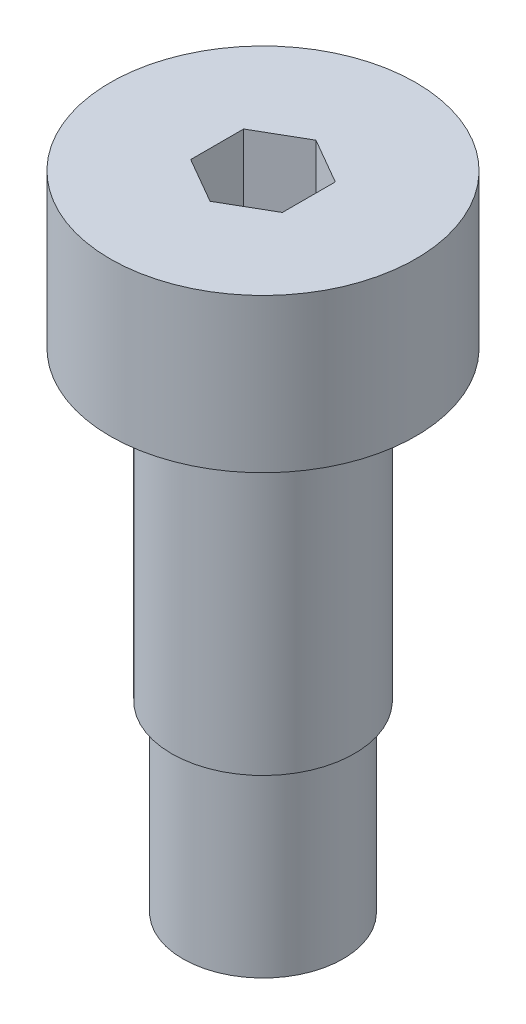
ISO-10303-21;
HEADER;
FILE_DESCRIPTION(('STEP AP214'),'2;1');
FILE_NAME('part.step','',(''),(''),'','','');
FILE_SCHEMA(('AUTOMOTIVE_DESIGN { 1 0 10303 214 1 1 1 1 }'));
ENDSEC;
DATA;
#1=APPLICATION_CONTEXT('core data for automotive mechanical design processes');
#2=APPLICATION_PROTOCOL_DEFINITION('international standard','automotive_design',2000,#1);
#3=PRODUCT_CONTEXT('',#1,'mechanical');
#4=PRODUCT('Part','Part','',(#3));
#5=PRODUCT_RELATED_PRODUCT_CATEGORY('part','',(#4));
#6=PRODUCT_DEFINITION_FORMATION('','',#4);
#7=PRODUCT_DEFINITION_CONTEXT('part definition',#1,'design');
#8=PRODUCT_DEFINITION('design','',#6,#7);
#9=PRODUCT_DEFINITION_SHAPE('','',#8);
#10=(LENGTH_UNIT() NAMED_UNIT(*) SI_UNIT(.MILLI.,.METRE.));
#11=(NAMED_UNIT(*) PLANE_ANGLE_UNIT() SI_UNIT($,.RADIAN.));
#12=(NAMED_UNIT(*) SI_UNIT($,.STERADIAN.) SOLID_ANGLE_UNIT());
#13=UNCERTAINTY_MEASURE_WITH_UNIT(LENGTH_MEASURE(1.E-05),#10,'distance_accuracy_value','');
#14=(GEOMETRIC_REPRESENTATION_CONTEXT(3) GLOBAL_UNCERTAINTY_ASSIGNED_CONTEXT((#13)) GLOBAL_UNIT_ASSIGNED_CONTEXT((#10,
#11,#12)) REPRESENTATION_CONTEXT('',''));
#15=CARTESIAN_POINT('',(0.,0.,0.));
#16=DIRECTION('',(0.,0.,1.));
#17=DIRECTION('',(1.,0.,0.));
#18=AXIS2_PLACEMENT_3D('',#15,#16,#17);
#19=CARTESIAN_POINT('',(0.,3.9878,0.));
#20=DIRECTION('',(0.,-1.,0.));
#21=DIRECTION('',(0.,0.,-1.));
#22=AXIS2_PLACEMENT_3D('',#19,#20,#21);
#23=PLANE('',#22);
#24=DIRECTION('',(0.866025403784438,0.,-0.5));
#25=VECTOR('',#24,1.);
#26=CARTESIAN_POINT('',(0.,3.9878,1.37481532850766));
#27=LINE('',#26,#25);
#28=CARTESIAN_POINT('',(0.,3.9878,1.37481532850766));
#29=VERTEX_POINT('',#28);
#30=CARTESIAN_POINT('',(1.190625,3.9878,0.687407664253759));
#31=VERTEX_POINT('',#30);
#32=EDGE_CURVE('E102',#29,#31,#27,.T.);
#33=ORIENTED_EDGE('',*,*,#32,.F.);
#34=DIRECTION('',(0.866025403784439,0.,0.5));
#35=VECTOR('',#34,1.);
#36=CARTESIAN_POINT('',(-1.19062499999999,3.9878,0.68740766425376));
#37=LINE('',#36,#35);
#38=CARTESIAN_POINT('',(-1.19062499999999,3.9878,0.68740766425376));
#39=VERTEX_POINT('',#38);
#40=EDGE_CURVE('E48',#39,#29,#37,.T.);
#41=ORIENTED_EDGE('',*,*,#40,.F.);
#42=DIRECTION('',(0.,0.,1.));
#43=VECTOR('',#42,1.);
#44=CARTESIAN_POINT('',(-1.190625,3.9878,-0.687407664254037));
#45=LINE('',#44,#43);
#46=CARTESIAN_POINT('',(-1.190625,3.9878,-0.687407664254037));
#47=VERTEX_POINT('',#46);
#48=EDGE_CURVE('E117',#47,#39,#45,.T.);
#49=ORIENTED_EDGE('',*,*,#48,.F.);
#50=DIRECTION('',(-0.866025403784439,0.,0.5));
#51=VECTOR('',#50,1.);
#52=CARTESIAN_POINT('',(0.,3.9878,-1.37481532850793));
#53=LINE('',#52,#51);
#54=CARTESIAN_POINT('',(0.,3.9878,-1.37481532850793));
#55=VERTEX_POINT('',#54);
#56=EDGE_CURVE('E111',#55,#47,#53,.T.);
#57=ORIENTED_EDGE('',*,*,#56,.F.);
#58=DIRECTION('',(-0.866025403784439,0.,-0.5));
#59=VECTOR('',#58,1.);
#60=CARTESIAN_POINT('',(1.190625,3.9878,-0.687407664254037));
#61=LINE('',#60,#59);
#62=CARTESIAN_POINT('',(1.190625,3.9878,-0.687407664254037));
#63=VERTEX_POINT('',#62);
#64=EDGE_CURVE('E109',#63,#55,#61,.T.);
#65=ORIENTED_EDGE('',*,*,#64,.F.);
#66=DIRECTION('',(0.,0.,-1.));
#67=VECTOR('',#66,1.);
#68=CARTESIAN_POINT('',(1.190625,3.9878,0.687407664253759));
#69=LINE('',#68,#67);
#70=EDGE_CURVE('E91',#31,#63,#69,.T.);
#71=ORIENTED_EDGE('',*,*,#70,.F.);
#72=EDGE_LOOP('',(#33,#41,#49,#57,#65,#71));
#73=FACE_BOUND('',#72,.T.);
#74=CARTESIAN_POINT('',(0.,3.9878,0.));
#75=DIRECTION('',(0.,1.,0.));
#76=DIRECTION('',(0.,0.,1.));
#77=AXIS2_PLACEMENT_3D('',#74,#75,#76);
#78=CIRCLE('',#77,3.96875);
#79=CARTESIAN_POINT('',(0.,3.9878,3.96875000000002));
#80=VERTEX_POINT('',#79);
#81=EDGE_CURVE('E11',#80,#80,#78,.T.);
#82=ORIENTED_EDGE('',*,*,#81,.T.);
#83=EDGE_LOOP('',(#82));
#84=FACE_BOUND('',#83,.T.);
#85=ADVANCED_FACE('F34',(#73,#84),#23,.F.);
#86=CARTESIAN_POINT('',(0.,49.1434782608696,-1.38777878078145E-13));
#87=DIRECTION('',(0.,1.,0.));
#88=DIRECTION('',(0.,0.,1.));
#89=AXIS2_PLACEMENT_3D('',#86,#87,#88);
#90=CYLINDRICAL_SURFACE('',#89,3.96875000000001);
#91=ORIENTED_EDGE('',*,*,#81,.F.);
#92=EDGE_LOOP('',(#91));
#93=FACE_BOUND('',#92,.T.);
#94=CARTESIAN_POINT('',(0.,0.,0.));
#95=DIRECTION('',(0.,1.,0.));
#96=DIRECTION('',(0.,0.,1.));
#97=AXIS2_PLACEMENT_3D('',#94,#95,#96);
#98=CIRCLE('',#97,3.96875000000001);
#99=CARTESIAN_POINT('',(0.,0.,3.96875000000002));
#100=VERTEX_POINT('',#99);
#101=EDGE_CURVE('E41',#100,#100,#98,.T.);
#102=ORIENTED_EDGE('',*,*,#101,.T.);
#103=EDGE_LOOP('',(#102));
#104=FACE_BOUND('',#103,.T.);
#105=ADVANCED_FACE('F155',(#93,#104),#90,.T.);
#106=CARTESIAN_POINT('',(3.96875000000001,0.,0.));
#107=DIRECTION('',(0.,1.,0.));
#108=DIRECTION('',(0.,0.,1.));
#109=AXIS2_PLACEMENT_3D('',#106,#107,#108);
#110=PLANE('',#109);
#111=ORIENTED_EDGE('',*,*,#101,.F.);
#112=EDGE_LOOP('',(#111));
#113=FACE_BOUND('',#112,.T.);
#114=CARTESIAN_POINT('',(0.,0.,0.));
#115=DIRECTION('',(0.,1.,0.));
#116=DIRECTION('',(0.,0.,1.));
#117=AXIS2_PLACEMENT_3D('',#114,#115,#116);
#118=CIRCLE('',#117,2.37490000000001);
#119=CARTESIAN_POINT('',(0.,0.,2.37490000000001));
#120=VERTEX_POINT('',#119);
#121=EDGE_CURVE('E150',#120,#120,#118,.T.);
#122=ORIENTED_EDGE('',*,*,#121,.T.);
#123=EDGE_LOOP('',(#122));
#124=FACE_BOUND('',#123,.T.);
#125=ADVANCED_FACE('F157',(#113,#124),#110,.F.);
#126=CARTESIAN_POINT('',(0.,49.1434782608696,-1.38777878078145E-13));
#127=DIRECTION('',(0.,1.,0.));
#128=DIRECTION('',(0.,0.,1.));
#129=AXIS2_PLACEMENT_3D('',#126,#127,#128);
#130=CYLINDRICAL_SURFACE('',#129,2.37490000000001);
#131=ORIENTED_EDGE('',*,*,#121,.F.);
#132=EDGE_LOOP('',(#131));
#133=FACE_BOUND('',#132,.T.);
#134=CARTESIAN_POINT('',(0.,-7.9375,0.));
#135=DIRECTION('',(0.,1.,0.));
#136=DIRECTION('',(0.,0.,1.));
#137=AXIS2_PLACEMENT_3D('',#134,#135,#136);
#138=CIRCLE('',#137,2.37490000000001);
#139=CARTESIAN_POINT('',(0.,-7.9375,2.37490000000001));
#140=VERTEX_POINT('',#139);
#141=EDGE_CURVE('E147',#140,#140,#138,.T.);
#142=ORIENTED_EDGE('',*,*,#141,.T.);
#143=EDGE_LOOP('',(#142));
#144=FACE_BOUND('',#143,.T.);
#145=ADVANCED_FACE('F160',(#133,#144),#130,.T.);
#146=CARTESIAN_POINT('',(2.37490000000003,-7.9375,-1.38777878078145E-13));
#147=DIRECTION('',(0.,1.,0.));
#148=DIRECTION('',(0.,0.,1.));
#149=AXIS2_PLACEMENT_3D('',#146,#147,#148);
#150=PLANE('',#149);
#151=ORIENTED_EDGE('',*,*,#141,.F.);
#152=EDGE_LOOP('',(#151));
#153=FACE_BOUND('',#152,.T.);
#154=CARTESIAN_POINT('',(0.,-7.9375,0.));
#155=DIRECTION('',(0.,1.,0.));
#156=DIRECTION('',(0.,0.,1.));
#157=AXIS2_PLACEMENT_3D('',#154,#155,#156);
#158=CIRCLE('',#157,2.08280000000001);
#159=CARTESIAN_POINT('',(0.,-7.9375,2.08280000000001));
#160=VERTEX_POINT('',#159);
#161=EDGE_CURVE('E144',#160,#160,#158,.T.);
#162=ORIENTED_EDGE('',*,*,#161,.T.);
#163=EDGE_LOOP('',(#162));
#164=FACE_BOUND('',#163,.T.);
#165=ADVANCED_FACE('F166',(#153,#164),#150,.F.);
#166=CARTESIAN_POINT('',(0.,49.1434782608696,-1.38777878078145E-13));
#167=DIRECTION('',(0.,1.,0.));
#168=DIRECTION('',(0.,0.,1.));
#169=AXIS2_PLACEMENT_3D('',#166,#167,#168);
#170=CYLINDRICAL_SURFACE('',#169,2.08280000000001);
#171=ORIENTED_EDGE('',*,*,#161,.F.);
#172=EDGE_LOOP('',(#171));
#173=FACE_BOUND('',#172,.T.);
#174=CARTESIAN_POINT('',(0.,-12.7,0.));
#175=DIRECTION('',(0.,1.,0.));
#176=DIRECTION('',(0.,0.,1.));
#177=AXIS2_PLACEMENT_3D('',#174,#175,#176);
#178=CIRCLE('',#177,2.08280000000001);
#179=CARTESIAN_POINT('',(0.,-12.7,2.08280000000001));
#180=VERTEX_POINT('',#179);
#181=EDGE_CURVE('E135',#180,#180,#178,.T.);
#182=ORIENTED_EDGE('',*,*,#181,.T.);
#183=EDGE_LOOP('',(#182));
#184=FACE_BOUND('',#183,.T.);
#185=ADVANCED_FACE('F172',(#173,#184),#170,.T.);
#186=CARTESIAN_POINT('',(2.08280000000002,-12.7,0.));
#187=DIRECTION('',(0.,1.,0.));
#188=DIRECTION('',(0.,0.,1.));
#189=AXIS2_PLACEMENT_3D('',#186,#187,#188);
#190=PLANE('',#189);
#191=ORIENTED_EDGE('',*,*,#181,.F.);
#192=EDGE_LOOP('',(#191));
#193=FACE_BOUND('',#192,.T.);
#194=ADVANCED_FACE('F178',(#193),#190,.F.);
#195=CARTESIAN_POINT('',(-1.19062499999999,1.60655,0.68740766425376));
#196=DIRECTION('',(-0.5,0.,0.866025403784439));
#197=DIRECTION('',(0.866025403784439,0.,0.5));
#198=AXIS2_PLACEMENT_3D('',#195,#196,#197);
#199=PLANE('',#198);
#200=ORIENTED_EDGE('',*,*,#40,.T.);
#201=DIRECTION('',(0.,1.,0.));
#202=VECTOR('',#201,1.);
#203=CARTESIAN_POINT('',(0.,1.60655,1.37481532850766));
#204=LINE('',#203,#202);
#205=CARTESIAN_POINT('',(0.,1.60655,1.37481532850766));
#206=VERTEX_POINT('',#205);
#207=EDGE_CURVE('E99',#206,#29,#204,.T.);
#208=ORIENTED_EDGE('',*,*,#207,.F.);
#209=DIRECTION('',(0.866025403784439,0.,0.5));
#210=VECTOR('',#209,1.);
#211=CARTESIAN_POINT('',(-1.19062499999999,1.60655,0.68740766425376));
#212=LINE('',#211,#210);
#213=CARTESIAN_POINT('',(-1.19062499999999,1.60655,0.68740766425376));
#214=VERTEX_POINT('',#213);
#215=EDGE_CURVE('E119',#214,#206,#212,.T.);
#216=ORIENTED_EDGE('',*,*,#215,.F.);
#217=DIRECTION('',(0.,1.,0.));
#218=VECTOR('',#217,1.);
#219=CARTESIAN_POINT('',(-1.19062499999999,1.60655,0.68740766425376));
#220=LINE('',#219,#218);
#221=EDGE_CURVE('E55',#214,#39,#220,.T.);
#222=ORIENTED_EDGE('',*,*,#221,.T.);
#223=EDGE_LOOP('',(#200,#208,#216,#222));
#224=FACE_BOUND('',#223,.T.);
#225=ADVANCED_FACE('F183',(#224),#199,.F.);
#226=CARTESIAN_POINT('',(-1.190625,1.60655,-0.687407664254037));
#227=DIRECTION('',(-1.,0.,0.));
#228=DIRECTION('',(0.,0.,1.));
#229=AXIS2_PLACEMENT_3D('',#226,#227,#228);
#230=PLANE('',#229);
#231=ORIENTED_EDGE('',*,*,#48,.T.);
#232=ORIENTED_EDGE('',*,*,#221,.F.);
#233=DIRECTION('',(0.,0.,1.));
#234=VECTOR('',#233,1.);
#235=CARTESIAN_POINT('',(-1.190625,1.60655,-0.687407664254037));
#236=LINE('',#235,#234);
#237=CARTESIAN_POINT('',(-1.190625,1.60655,-0.687407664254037));
#238=VERTEX_POINT('',#237);
#239=EDGE_CURVE('E131',#238,#214,#236,.T.);
#240=ORIENTED_EDGE('',*,*,#239,.F.);
#241=DIRECTION('',(0.,1.,0.));
#242=VECTOR('',#241,1.);
#243=CARTESIAN_POINT('',(-1.190625,1.60655,-0.687407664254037));
#244=LINE('',#243,#242);
#245=EDGE_CURVE('E136',#238,#47,#244,.T.);
#246=ORIENTED_EDGE('',*,*,#245,.T.);
#247=EDGE_LOOP('',(#231,#232,#240,#246));
#248=FACE_BOUND('',#247,.T.);
#249=ADVANCED_FACE('F188',(#248),#230,.F.);
#250=CARTESIAN_POINT('',(0.,1.60655,-1.37481532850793));
#251=DIRECTION('',(-0.5,0.,-0.866025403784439));
#252=DIRECTION('',(-0.866025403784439,0.,0.5));
#253=AXIS2_PLACEMENT_3D('',#250,#251,#252);
#254=PLANE('',#253);
#255=ORIENTED_EDGE('',*,*,#56,.T.);
#256=ORIENTED_EDGE('',*,*,#245,.F.);
#257=DIRECTION('',(-0.866025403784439,0.,0.5));
#258=VECTOR('',#257,1.);
#259=CARTESIAN_POINT('',(0.,1.60655,-1.37481532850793));
#260=LINE('',#259,#258);
#261=CARTESIAN_POINT('',(0.,1.60655,-1.37481532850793));
#262=VERTEX_POINT('',#261);
#263=EDGE_CURVE('E128',#262,#238,#260,.T.);
#264=ORIENTED_EDGE('',*,*,#263,.F.);
#265=DIRECTION('',(0.,1.,0.));
#266=VECTOR('',#265,1.);
#267=CARTESIAN_POINT('',(0.,1.60655,-1.37481532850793));
#268=LINE('',#267,#266);
#269=EDGE_CURVE('E138',#262,#55,#268,.T.);
#270=ORIENTED_EDGE('',*,*,#269,.T.);
#271=EDGE_LOOP('',(#255,#256,#264,#270));
#272=FACE_BOUND('',#271,.T.);
#273=ADVANCED_FACE('F237',(#272),#254,.F.);
#274=CARTESIAN_POINT('',(1.190625,1.60655,-0.687407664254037));
#275=DIRECTION('',(0.5,0.,-0.866025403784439));
#276=DIRECTION('',(-0.866025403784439,0.,-0.5));
#277=AXIS2_PLACEMENT_3D('',#274,#275,#276);
#278=PLANE('',#277);
#279=ORIENTED_EDGE('',*,*,#64,.T.);
#280=ORIENTED_EDGE('',*,*,#269,.F.);
#281=DIRECTION('',(-0.866025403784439,0.,-0.5));
#282=VECTOR('',#281,1.);
#283=CARTESIAN_POINT('',(1.190625,1.60655,-0.687407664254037));
#284=LINE('',#283,#282);
#285=CARTESIAN_POINT('',(1.190625,1.60655,-0.687407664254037));
#286=VERTEX_POINT('',#285);
#287=EDGE_CURVE('E125',#286,#262,#284,.T.);
#288=ORIENTED_EDGE('',*,*,#287,.F.);
#289=DIRECTION('',(0.,1.,0.));
#290=VECTOR('',#289,1.);
#291=CARTESIAN_POINT('',(1.190625,1.60655,-0.687407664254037));
#292=LINE('',#291,#290);
#293=EDGE_CURVE('E98',#286,#63,#292,.T.);
#294=ORIENTED_EDGE('',*,*,#293,.T.);
#295=EDGE_LOOP('',(#279,#280,#288,#294));
#296=FACE_BOUND('',#295,.T.);
#297=ADVANCED_FACE('F246',(#296),#278,.F.);
#298=CARTESIAN_POINT('',(1.190625,1.60655,0.687407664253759));
#299=DIRECTION('',(1.,0.,0.));
#300=DIRECTION('',(0.,0.,-1.));
#301=AXIS2_PLACEMENT_3D('',#298,#299,#300);
#302=PLANE('',#301);
#303=ORIENTED_EDGE('',*,*,#70,.T.);
#304=ORIENTED_EDGE('',*,*,#293,.F.);
#305=DIRECTION('',(0.,0.,-1.));
#306=VECTOR('',#305,1.);
#307=CARTESIAN_POINT('',(1.190625,1.60655,0.687407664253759));
#308=LINE('',#307,#306);
#309=CARTESIAN_POINT('',(1.190625,1.60655,0.687407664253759));
#310=VERTEX_POINT('',#309);
#311=EDGE_CURVE('E94',#310,#286,#308,.T.);
#312=ORIENTED_EDGE('',*,*,#311,.F.);
#313=DIRECTION('',(0.,1.,0.));
#314=VECTOR('',#313,1.);
#315=CARTESIAN_POINT('',(1.190625,1.60655,0.687407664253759));
#316=LINE('',#315,#314);
#317=EDGE_CURVE('E87',#310,#31,#316,.T.);
#318=ORIENTED_EDGE('',*,*,#317,.T.);
#319=EDGE_LOOP('',(#303,#304,#312,#318));
#320=FACE_BOUND('',#319,.T.);
#321=ADVANCED_FACE('F89',(#320),#302,.F.);
#322=CARTESIAN_POINT('',(0.,1.60655,1.37481532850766));
#323=DIRECTION('',(0.5,0.,0.866025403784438));
#324=DIRECTION('',(0.866025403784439,0.,-0.5));
#325=AXIS2_PLACEMENT_3D('',#322,#323,#324);
#326=PLANE('',#325);
#327=ORIENTED_EDGE('',*,*,#32,.T.);
#328=ORIENTED_EDGE('',*,*,#317,.F.);
#329=DIRECTION('',(0.866025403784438,0.,-0.5));
#330=VECTOR('',#329,1.);
#331=CARTESIAN_POINT('',(0.,1.60655,1.37481532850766));
#332=LINE('',#331,#330);
#333=EDGE_CURVE('E122',#206,#310,#332,.T.);
#334=ORIENTED_EDGE('',*,*,#333,.F.);
#335=ORIENTED_EDGE('',*,*,#207,.T.);
#336=EDGE_LOOP('',(#327,#328,#334,#335));
#337=FACE_BOUND('',#336,.T.);
#338=ADVANCED_FACE('F103',(#337),#326,.F.);
#339=CARTESIAN_POINT('',(0.,1.60655,1.37481532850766));
#340=DIRECTION('',(0.,1.,0.));
#341=DIRECTION('',(0.,0.,1.));
#342=AXIS2_PLACEMENT_3D('',#339,#340,#341);
#343=PLANE('',#342);
#344=ORIENTED_EDGE('',*,*,#215,.T.);
#345=ORIENTED_EDGE('',*,*,#333,.T.);
#346=ORIENTED_EDGE('',*,*,#311,.T.);
#347=ORIENTED_EDGE('',*,*,#287,.T.);
#348=ORIENTED_EDGE('',*,*,#263,.T.);
#349=ORIENTED_EDGE('',*,*,#239,.T.);
#350=EDGE_LOOP('',(#344,#345,#346,#347,#348,#349));
#351=FACE_BOUND('',#350,.T.);
#352=ADVANCED_FACE('F273',(#351),#343,.T.);
#353=CLOSED_SHELL('',(#85,#105,#125,#145,#165,#185,#194,#225,#249,#273,#297,#321,#338,#352));
#354=MANIFOLD_SOLID_BREP('B2',#353);
#355=ADVANCED_BREP_SHAPE_REPRESENTATION('',(#18,#354),#14);
#356=SHAPE_DEFINITION_REPRESENTATION(#9,#355);
ENDSEC;
END-ISO-10303-21;
